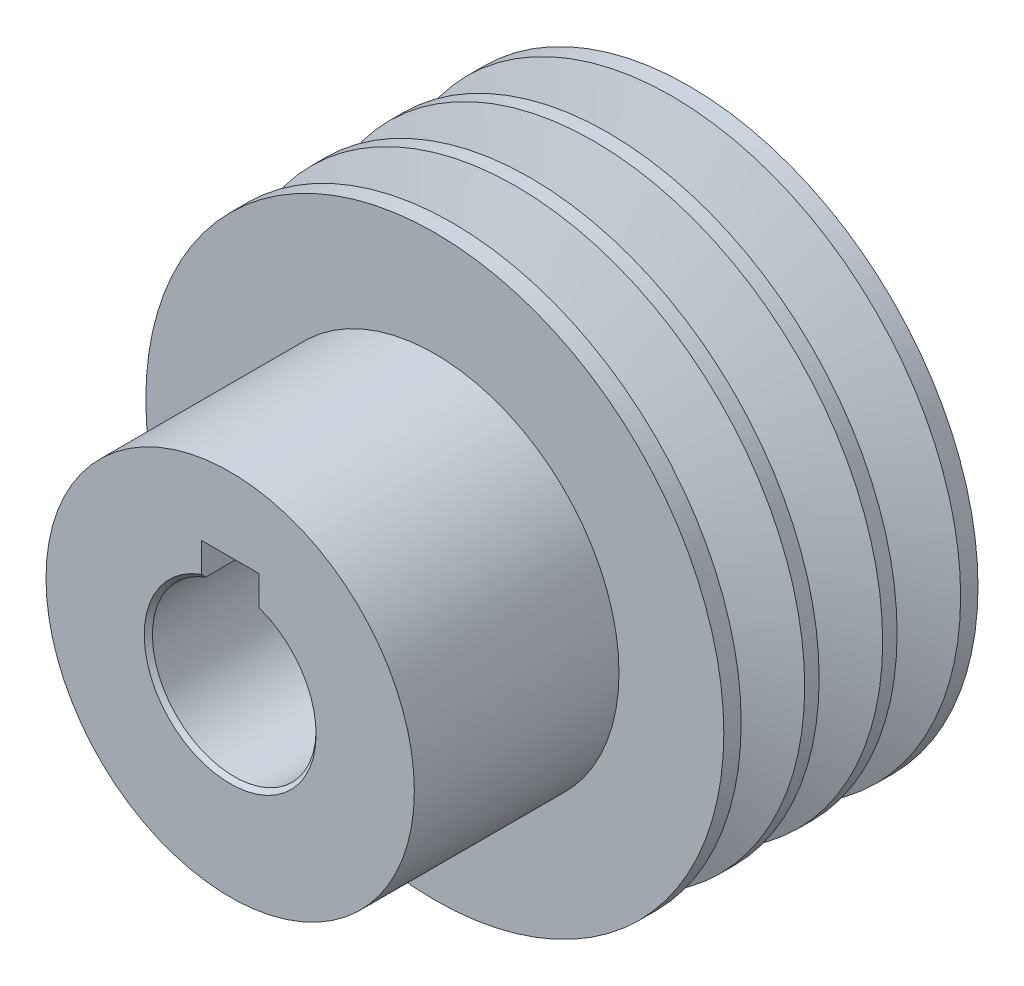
ISO-10303-21;
HEADER;
FILE_DESCRIPTION(('STEP AP214'),'2;1');
FILE_NAME('part.step','',(''),(''),'','','');
FILE_SCHEMA(('AUTOMOTIVE_DESIGN { 1 0 10303 214 1 1 1 1 }'));
ENDSEC;
DATA;
#1=APPLICATION_CONTEXT('core data for automotive mechanical design processes');
#2=APPLICATION_PROTOCOL_DEFINITION('international standard','automotive_design',2000,#1);
#3=PRODUCT_CONTEXT('',#1,'mechanical');
#4=PRODUCT('Part','Part','',(#3));
#5=PRODUCT_RELATED_PRODUCT_CATEGORY('part','',(#4));
#6=PRODUCT_DEFINITION_FORMATION('','',#4);
#7=PRODUCT_DEFINITION_CONTEXT('part definition',#1,'design');
#8=PRODUCT_DEFINITION('design','',#6,#7);
#9=PRODUCT_DEFINITION_SHAPE('','',#8);
#10=(LENGTH_UNIT() NAMED_UNIT(*) SI_UNIT(.MILLI.,.METRE.));
#11=(NAMED_UNIT(*) PLANE_ANGLE_UNIT() SI_UNIT($,.RADIAN.));
#12=(NAMED_UNIT(*) SI_UNIT($,.STERADIAN.) SOLID_ANGLE_UNIT());
#13=UNCERTAINTY_MEASURE_WITH_UNIT(LENGTH_MEASURE(1.E-05),#10,'distance_accuracy_value','');
#14=(GEOMETRIC_REPRESENTATION_CONTEXT(3) GLOBAL_UNCERTAINTY_ASSIGNED_CONTEXT((#13)) GLOBAL_UNIT_ASSIGNED_CONTEXT((#10,
#11,#12)) REPRESENTATION_CONTEXT('',''));
#15=CARTESIAN_POINT('',(0.,0.,0.));
#16=DIRECTION('',(0.,0.,1.));
#17=DIRECTION('',(1.,0.,0.));
#18=AXIS2_PLACEMENT_3D('',#15,#16,#17);
#19=CARTESIAN_POINT('',(0.,70.6119995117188,50.1014986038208));
#20=DIRECTION('',(0.,0.,-1.));
#21=DIRECTION('',(-1.,0.,0.));
#22=AXIS2_PLACEMENT_3D('',#19,#20,#21);
#23=PLANE('',#22);
#24=CARTESIAN_POINT('',(0.,0.,50.1014986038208));
#25=DIRECTION('',(0.,0.,1.));
#26=DIRECTION('',(1.,0.,0.));
#27=AXIS2_PLACEMENT_3D('',#24,#25,#26);
#28=CIRCLE('',#27,70.6119995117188);
#29=CARTESIAN_POINT('',(70.6119995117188,0.,50.1014986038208));
#30=VERTEX_POINT('',#29);
#31=EDGE_CURVE('E125',#30,#30,#28,.T.);
#32=ORIENTED_EDGE('',*,*,#31,.T.);
#33=EDGE_LOOP('',(#32));
#34=FACE_BOUND('',#33,.T.);
#35=CARTESIAN_POINT('',(0.,0.,50.1014986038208));
#36=DIRECTION('',(0.,0.,-1.));
#37=DIRECTION('',(-1.,0.,0.));
#38=AXIS2_PLACEMENT_3D('',#35,#36,#37);
#39=CIRCLE('',#38,45.);
#40=CARTESIAN_POINT('',(-45.,0.,50.1014986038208));
#41=VERTEX_POINT('',#40);
#42=EDGE_CURVE('E167',#41,#41,#39,.F.);
#43=ORIENTED_EDGE('',*,*,#42,.F.);
#44=EDGE_LOOP('',(#43));
#45=FACE_BOUND('',#44,.T.);
#46=ADVANCED_FACE('F30',(#34,#45),#23,.F.);
#47=CARTESIAN_POINT('',(0.,0.,-12.0015001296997));
#48=DIRECTION('',(0.,0.,1.));
#49=DIRECTION('',(1.,0.,0.));
#50=AXIS2_PLACEMENT_3D('',#47,#48,#49);
#51=PLANE('',#50);
#52=DIRECTION('',(0.,-1.,0.));
#53=VECTOR('',#52,1.);
#54=CARTESIAN_POINT('',(-7.,27.,-12.0015001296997));
#55=LINE('',#54,#53);
#56=CARTESIAN_POINT('',(-7.,27.,-12.0015001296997));
#57=VERTEX_POINT('',#56);
#58=CARTESIAN_POINT('',(-7.,19.7989898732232,-12.0015001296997));
#59=VERTEX_POINT('',#58);
#60=EDGE_CURVE('E97',#57,#59,#55,.T.);
#61=ORIENTED_EDGE('',*,*,#60,.T.);
#62=CARTESIAN_POINT('',(0.,0.,-12.0015001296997));
#63=DIRECTION('',(0.,0.,1.));
#64=DIRECTION('',(1.,0.,0.));
#65=AXIS2_PLACEMENT_3D('',#62,#63,#64);
#66=CIRCLE('',#65,20.9999999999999);
#67=CARTESIAN_POINT('',(7.,19.7989898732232,-12.0015001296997));
#68=VERTEX_POINT('',#67);
#69=EDGE_CURVE('E170',#59,#68,#66,.T.);
#70=ORIENTED_EDGE('',*,*,#69,.T.);
#71=DIRECTION('',(0.,1.,0.));
#72=VECTOR('',#71,1.);
#73=CARTESIAN_POINT('',(7.,18.7349939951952,-12.0015001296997));
#74=LINE('',#73,#72);
#75=CARTESIAN_POINT('',(7.,27.,-12.0015001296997));
#76=VERTEX_POINT('',#75);
#77=EDGE_CURVE('E94',#68,#76,#74,.T.);
#78=ORIENTED_EDGE('',*,*,#77,.T.);
#79=DIRECTION('',(-1.,0.,0.));
#80=VECTOR('',#79,1.);
#81=CARTESIAN_POINT('',(7.,27.,-12.0015001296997));
#82=LINE('',#81,#80);
#83=EDGE_CURVE('E90',#76,#57,#82,.T.);
#84=ORIENTED_EDGE('',*,*,#83,.T.);
#85=EDGE_LOOP('',(#61,#70,#78,#84));
#86=FACE_BOUND('',#85,.T.);
#87=CARTESIAN_POINT('',(0.,0.,-12.0015001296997));
#88=DIRECTION('',(0.,0.,1.));
#89=DIRECTION('',(1.,0.,0.));
#90=AXIS2_PLACEMENT_3D('',#87,#88,#89);
#91=CIRCLE('',#90,70.6119995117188);
#92=CARTESIAN_POINT('',(70.6119995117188,0.,-12.0015001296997));
#93=VERTEX_POINT('',#92);
#94=EDGE_CURVE('E164',#93,#93,#91,.T.);
#95=ORIENTED_EDGE('',*,*,#94,.F.);
#96=EDGE_LOOP('',(#95));
#97=FACE_BOUND('',#96,.T.);
#98=ADVANCED_FACE('F104',(#86,#97),#51,.F.);
#99=CARTESIAN_POINT('',(0.,0.,62.1029987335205));
#100=DIRECTION('',(0.,0.,1.));
#101=DIRECTION('',(1.,0.,0.));
#102=AXIS2_PLACEMENT_3D('',#99,#100,#101);
#103=CYLINDRICAL_SURFACE('',#102,70.6119995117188);
#104=CARTESIAN_POINT('',(0.,0.,-7.75969982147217));
#105=DIRECTION('',(0.,0.,1.));
#106=DIRECTION('',(1.,0.,0.));
#107=AXIS2_PLACEMENT_3D('',#104,#105,#106);
#108=CIRCLE('',#107,70.6119995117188);
#109=CARTESIAN_POINT('',(70.6119995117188,0.,-7.75969982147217));
#110=VERTEX_POINT('',#109);
#111=EDGE_CURVE('E161',#110,#110,#108,.T.);
#112=ORIENTED_EDGE('',*,*,#111,.F.);
#113=EDGE_LOOP('',(#112));
#114=FACE_BOUND('',#113,.T.);
#115=ORIENTED_EDGE('',*,*,#94,.T.);
#116=EDGE_LOOP('',(#115));
#117=FACE_BOUND('',#116,.T.);
#118=ADVANCED_FACE('F214',(#114,#117),#103,.T.);
#119=CARTESIAN_POINT('',(0.,0.,-7.75969982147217));
#120=DIRECTION('',(0.,0.,-1.));
#121=DIRECTION('',(-1.,0.,0.));
#122=AXIS2_PLACEMENT_3D('',#119,#120,#121);
#123=CONICAL_SURFACE('',#122,70.6119995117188,1.23918377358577);
#124=CARTESIAN_POINT('',(0.,0.,-2.11858081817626));
#125=DIRECTION('',(0.,0.,1.));
#126=DIRECTION('',(1.,0.,0.));
#127=AXIS2_PLACEMENT_3D('',#124,#125,#126);
#128=CIRCLE('',#127,54.2290000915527);
#129=CARTESIAN_POINT('',(54.2290000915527,0.,-2.11858081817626));
#130=VERTEX_POINT('',#129);
#131=EDGE_CURVE('E158',#130,#130,#128,.T.);
#132=ORIENTED_EDGE('',*,*,#131,.F.);
#133=EDGE_LOOP('',(#132));
#134=FACE_BOUND('',#133,.T.);
#135=ORIENTED_EDGE('',*,*,#111,.T.);
#136=EDGE_LOOP('',(#135));
#137=FACE_BOUND('',#136,.T.);
#138=ADVANCED_FACE('F217',(#134,#137),#123,.T.);
#139=CARTESIAN_POINT('',(0.,0.,62.1029987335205));
#140=DIRECTION('',(0.,0.,1.));
#141=DIRECTION('',(1.,0.,0.));
#142=AXIS2_PLACEMENT_3D('',#139,#140,#141);
#143=CYLINDRICAL_SURFACE('',#142,54.2290000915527);
#144=CARTESIAN_POINT('',(0.,0.,2.11858081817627));
#145=DIRECTION('',(0.,0.,1.));
#146=DIRECTION('',(1.,0.,0.));
#147=AXIS2_PLACEMENT_3D('',#144,#145,#146);
#148=CIRCLE('',#147,54.2290000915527);
#149=CARTESIAN_POINT('',(54.2290000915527,0.,2.11858081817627));
#150=VERTEX_POINT('',#149);
#151=EDGE_CURVE('E155',#150,#150,#148,.T.);
#152=ORIENTED_EDGE('',*,*,#151,.F.);
#153=EDGE_LOOP('',(#152));
#154=FACE_BOUND('',#153,.T.);
#155=ORIENTED_EDGE('',*,*,#131,.T.);
#156=EDGE_LOOP('',(#155));
#157=FACE_BOUND('',#156,.T.);
#158=ADVANCED_FACE('F221',(#154,#157),#143,.T.);
#159=CARTESIAN_POINT('',(0.,0.,2.11858081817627));
#160=DIRECTION('',(0.,0.,1.));
#161=DIRECTION('',(1.,0.,0.));
#162=AXIS2_PLACEMENT_3D('',#159,#160,#161);
#163=CONICAL_SURFACE('',#162,54.2290000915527,1.23918377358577);
#164=CARTESIAN_POINT('',(0.,0.,7.75969982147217));
#165=DIRECTION('',(0.,0.,1.));
#166=DIRECTION('',(1.,0.,0.));
#167=AXIS2_PLACEMENT_3D('',#164,#165,#166);
#168=CIRCLE('',#167,70.6119995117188);
#169=CARTESIAN_POINT('',(70.6119995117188,0.,7.75969982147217));
#170=VERTEX_POINT('',#169);
#171=EDGE_CURVE('E152',#170,#170,#168,.T.);
#172=ORIENTED_EDGE('',*,*,#171,.F.);
#173=EDGE_LOOP('',(#172));
#174=FACE_BOUND('',#173,.T.);
#175=ORIENTED_EDGE('',*,*,#151,.T.);
#176=EDGE_LOOP('',(#175));
#177=FACE_BOUND('',#176,.T.);
#178=ADVANCED_FACE('F225',(#174,#177),#163,.T.);
#179=CARTESIAN_POINT('',(0.,0.,62.1029987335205));
#180=DIRECTION('',(0.,0.,1.));
#181=DIRECTION('',(1.,0.,0.));
#182=AXIS2_PLACEMENT_3D('',#179,#180,#181);
#183=CYLINDRICAL_SURFACE('',#182,70.6119995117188);
#184=CARTESIAN_POINT('',(0.,0.,11.2902994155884));
#185=DIRECTION('',(0.,0.,1.));
#186=DIRECTION('',(1.,0.,0.));
#187=AXIS2_PLACEMENT_3D('',#184,#185,#186);
#188=CIRCLE('',#187,70.6119995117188);
#189=CARTESIAN_POINT('',(70.6119995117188,0.,11.2902994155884));
#190=VERTEX_POINT('',#189);
#191=EDGE_CURVE('E149',#190,#190,#188,.T.);
#192=ORIENTED_EDGE('',*,*,#191,.F.);
#193=EDGE_LOOP('',(#192));
#194=FACE_BOUND('',#193,.T.);
#195=ORIENTED_EDGE('',*,*,#171,.T.);
#196=EDGE_LOOP('',(#195));
#197=FACE_BOUND('',#196,.T.);
#198=ADVANCED_FACE('F229',(#194,#197),#183,.T.);
#199=CARTESIAN_POINT('',(0.,0.,11.2902994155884));
#200=DIRECTION('',(0.,0.,-1.));
#201=DIRECTION('',(-1.,0.,0.));
#202=AXIS2_PLACEMENT_3D('',#199,#200,#201);
#203=CONICAL_SURFACE('',#202,70.6119995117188,1.23918377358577);
#204=CARTESIAN_POINT('',(0.,0.,16.9314184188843));
#205=DIRECTION('',(0.,0.,1.));
#206=DIRECTION('',(1.,0.,0.));
#207=AXIS2_PLACEMENT_3D('',#204,#205,#206);
#208=CIRCLE('',#207,54.2290000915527);
#209=CARTESIAN_POINT('',(54.2290000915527,0.,16.9314184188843));
#210=VERTEX_POINT('',#209);
#211=EDGE_CURVE('E146',#210,#210,#208,.T.);
#212=ORIENTED_EDGE('',*,*,#211,.F.);
#213=EDGE_LOOP('',(#212));
#214=FACE_BOUND('',#213,.T.);
#215=ORIENTED_EDGE('',*,*,#191,.T.);
#216=EDGE_LOOP('',(#215));
#217=FACE_BOUND('',#216,.T.);
#218=ADVANCED_FACE('F233',(#214,#217),#203,.T.);
#219=CARTESIAN_POINT('',(0.,0.,62.1029987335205));
#220=DIRECTION('',(0.,0.,1.));
#221=DIRECTION('',(1.,0.,0.));
#222=AXIS2_PLACEMENT_3D('',#219,#220,#221);
#223=CYLINDRICAL_SURFACE('',#222,54.2290000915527);
#224=CARTESIAN_POINT('',(0.,0.,21.1685800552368));
#225=DIRECTION('',(0.,0.,1.));
#226=DIRECTION('',(1.,0.,0.));
#227=AXIS2_PLACEMENT_3D('',#224,#225,#226);
#228=CIRCLE('',#227,54.2290000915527);
#229=CARTESIAN_POINT('',(54.2290000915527,0.,21.1685800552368));
#230=VERTEX_POINT('',#229);
#231=EDGE_CURVE('E143',#230,#230,#228,.T.);
#232=ORIENTED_EDGE('',*,*,#231,.F.);
#233=EDGE_LOOP('',(#232));
#234=FACE_BOUND('',#233,.T.);
#235=ORIENTED_EDGE('',*,*,#211,.T.);
#236=EDGE_LOOP('',(#235));
#237=FACE_BOUND('',#236,.T.);
#238=ADVANCED_FACE('F237',(#234,#237),#223,.T.);
#239=CARTESIAN_POINT('',(0.,0.,21.1685800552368));
#240=DIRECTION('',(0.,0.,1.));
#241=DIRECTION('',(1.,0.,0.));
#242=AXIS2_PLACEMENT_3D('',#239,#240,#241);
#243=CONICAL_SURFACE('',#242,54.2290000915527,1.23918377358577);
#244=CARTESIAN_POINT('',(0.,0.,26.8096990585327));
#245=DIRECTION('',(0.,0.,1.));
#246=DIRECTION('',(1.,0.,0.));
#247=AXIS2_PLACEMENT_3D('',#244,#245,#246);
#248=CIRCLE('',#247,70.6119995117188);
#249=CARTESIAN_POINT('',(70.6119995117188,0.,26.8096990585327));
#250=VERTEX_POINT('',#249);
#251=EDGE_CURVE('E140',#250,#250,#248,.T.);
#252=ORIENTED_EDGE('',*,*,#251,.F.);
#253=EDGE_LOOP('',(#252));
#254=FACE_BOUND('',#253,.T.);
#255=ORIENTED_EDGE('',*,*,#231,.T.);
#256=EDGE_LOOP('',(#255));
#257=FACE_BOUND('',#256,.T.);
#258=ADVANCED_FACE('F241',(#254,#257),#243,.T.);
#259=CARTESIAN_POINT('',(0.,0.,62.1029987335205));
#260=DIRECTION('',(0.,0.,1.));
#261=DIRECTION('',(1.,0.,0.));
#262=AXIS2_PLACEMENT_3D('',#259,#260,#261);
#263=CYLINDRICAL_SURFACE('',#262,70.6119995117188);
#264=CARTESIAN_POINT('',(0.,0.,30.3402986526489));
#265=DIRECTION('',(0.,0.,1.));
#266=DIRECTION('',(1.,0.,0.));
#267=AXIS2_PLACEMENT_3D('',#264,#265,#266);
#268=CIRCLE('',#267,70.6119995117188);
#269=CARTESIAN_POINT('',(70.6119995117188,0.,30.3402986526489));
#270=VERTEX_POINT('',#269);
#271=EDGE_CURVE('E137',#270,#270,#268,.T.);
#272=ORIENTED_EDGE('',*,*,#271,.F.);
#273=EDGE_LOOP('',(#272));
#274=FACE_BOUND('',#273,.T.);
#275=ORIENTED_EDGE('',*,*,#251,.T.);
#276=EDGE_LOOP('',(#275));
#277=FACE_BOUND('',#276,.T.);
#278=ADVANCED_FACE('F245',(#274,#277),#263,.T.);
#279=CARTESIAN_POINT('',(0.,0.,30.3402986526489));
#280=DIRECTION('',(0.,0.,-1.));
#281=DIRECTION('',(-1.,0.,0.));
#282=AXIS2_PLACEMENT_3D('',#279,#280,#281);
#283=CONICAL_SURFACE('',#282,70.6119995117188,1.23918377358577);
#284=CARTESIAN_POINT('',(0.,0.,35.9814176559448));
#285=DIRECTION('',(0.,0.,1.));
#286=DIRECTION('',(1.,0.,0.));
#287=AXIS2_PLACEMENT_3D('',#284,#285,#286);
#288=CIRCLE('',#287,54.2290000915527);
#289=CARTESIAN_POINT('',(54.2290000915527,0.,35.9814176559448));
#290=VERTEX_POINT('',#289);
#291=EDGE_CURVE('E134',#290,#290,#288,.T.);
#292=ORIENTED_EDGE('',*,*,#291,.F.);
#293=EDGE_LOOP('',(#292));
#294=FACE_BOUND('',#293,.T.);
#295=ORIENTED_EDGE('',*,*,#271,.T.);
#296=EDGE_LOOP('',(#295));
#297=FACE_BOUND('',#296,.T.);
#298=ADVANCED_FACE('F249',(#294,#297),#283,.T.);
#299=CARTESIAN_POINT('',(0.,0.,62.1029987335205));
#300=DIRECTION('',(0.,0.,1.));
#301=DIRECTION('',(1.,0.,0.));
#302=AXIS2_PLACEMENT_3D('',#299,#300,#301);
#303=CYLINDRICAL_SURFACE('',#302,54.2290000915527);
#304=CARTESIAN_POINT('',(0.,0.,40.2185792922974));
#305=DIRECTION('',(0.,0.,1.));
#306=DIRECTION('',(1.,0.,0.));
#307=AXIS2_PLACEMENT_3D('',#304,#305,#306);
#308=CIRCLE('',#307,54.2290000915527);
#309=CARTESIAN_POINT('',(54.2290000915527,0.,40.2185792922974));
#310=VERTEX_POINT('',#309);
#311=EDGE_CURVE('E131',#310,#310,#308,.T.);
#312=ORIENTED_EDGE('',*,*,#311,.F.);
#313=EDGE_LOOP('',(#312));
#314=FACE_BOUND('',#313,.T.);
#315=ORIENTED_EDGE('',*,*,#291,.T.);
#316=EDGE_LOOP('',(#315));
#317=FACE_BOUND('',#316,.T.);
#318=ADVANCED_FACE('F253',(#314,#317),#303,.T.);
#319=CARTESIAN_POINT('',(0.,0.,40.2185792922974));
#320=DIRECTION('',(0.,0.,1.));
#321=DIRECTION('',(1.,0.,0.));
#322=AXIS2_PLACEMENT_3D('',#319,#320,#321);
#323=CONICAL_SURFACE('',#322,54.2290000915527,1.23918377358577);
#324=CARTESIAN_POINT('',(0.,0.,45.8596982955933));
#325=DIRECTION('',(0.,0.,1.));
#326=DIRECTION('',(1.,0.,0.));
#327=AXIS2_PLACEMENT_3D('',#324,#325,#326);
#328=CIRCLE('',#327,70.6119995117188);
#329=CARTESIAN_POINT('',(70.6119995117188,0.,45.8596982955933));
#330=VERTEX_POINT('',#329);
#331=EDGE_CURVE('E128',#330,#330,#328,.T.);
#332=ORIENTED_EDGE('',*,*,#331,.F.);
#333=EDGE_LOOP('',(#332));
#334=FACE_BOUND('',#333,.T.);
#335=ORIENTED_EDGE('',*,*,#311,.T.);
#336=EDGE_LOOP('',(#335));
#337=FACE_BOUND('',#336,.T.);
#338=ADVANCED_FACE('F257',(#334,#337),#323,.T.);
#339=CARTESIAN_POINT('',(0.,0.,62.1029987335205));
#340=DIRECTION('',(0.,0.,1.));
#341=DIRECTION('',(1.,0.,0.));
#342=AXIS2_PLACEMENT_3D('',#339,#340,#341);
#343=CYLINDRICAL_SURFACE('',#342,70.6119995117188);
#344=ORIENTED_EDGE('',*,*,#31,.F.);
#345=EDGE_LOOP('',(#344));
#346=FACE_BOUND('',#345,.T.);
#347=ORIENTED_EDGE('',*,*,#331,.T.);
#348=EDGE_LOOP('',(#347));
#349=FACE_BOUND('',#348,.T.);
#350=ADVANCED_FACE('F261',(#346,#349),#343,.T.);
#351=CARTESIAN_POINT('',(0.,0.,100.101498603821));
#352=DIRECTION('',(0.,0.,-1.));
#353=DIRECTION('',(-1.,0.,0.));
#354=AXIS2_PLACEMENT_3D('',#351,#352,#353);
#355=CYLINDRICAL_SURFACE('',#354,45.);
#356=CARTESIAN_POINT('',(0.,0.,100.101498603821));
#357=DIRECTION('',(0.,0.,1.));
#358=DIRECTION('',(1.,0.,0.));
#359=AXIS2_PLACEMENT_3D('',#356,#357,#358);
#360=CIRCLE('',#359,45.);
#361=CARTESIAN_POINT('',(45.,0.,100.101498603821));
#362=VERTEX_POINT('',#361);
#363=EDGE_CURVE('E118',#362,#362,#360,.T.);
#364=ORIENTED_EDGE('',*,*,#363,.F.);
#365=EDGE_LOOP('',(#364));
#366=FACE_BOUND('',#365,.T.);
#367=ORIENTED_EDGE('',*,*,#42,.T.);
#368=EDGE_LOOP('',(#367));
#369=FACE_BOUND('',#368,.T.);
#370=ADVANCED_FACE('F265',(#366,#369),#355,.T.);
#371=CARTESIAN_POINT('',(0.,0.,100.101498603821));
#372=DIRECTION('',(0.,0.,1.));
#373=DIRECTION('',(1.,0.,0.));
#374=AXIS2_PLACEMENT_3D('',#371,#372,#373);
#375=PLANE('',#374);
#376=DIRECTION('',(0.,1.,0.));
#377=VECTOR('',#376,1.);
#378=CARTESIAN_POINT('',(7.,18.7349939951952,100.101498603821));
#379=LINE('',#378,#377);
#380=CARTESIAN_POINT('',(7.,19.7989898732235,100.101498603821));
#381=VERTEX_POINT('',#380);
#382=CARTESIAN_POINT('',(7.,27.,100.101498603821));
#383=VERTEX_POINT('',#382);
#384=EDGE_CURVE('E108',#381,#383,#379,.T.);
#385=ORIENTED_EDGE('',*,*,#384,.F.);
#386=CARTESIAN_POINT('',(0.,0.,100.101498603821));
#387=DIRECTION('',(0.,0.,1.));
#388=DIRECTION('',(1.,0.,0.));
#389=AXIS2_PLACEMENT_3D('',#386,#387,#388);
#390=CIRCLE('',#389,21.0000000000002);
#391=CARTESIAN_POINT('',(-7.,19.7989898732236,100.101498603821));
#392=VERTEX_POINT('',#391);
#393=EDGE_CURVE('E11',#381,#392,#390,.F.);
#394=ORIENTED_EDGE('',*,*,#393,.T.);
#395=DIRECTION('',(0.,-1.,0.));
#396=VECTOR('',#395,1.);
#397=CARTESIAN_POINT('',(-7.,27.,100.101498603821));
#398=LINE('',#397,#396);
#399=CARTESIAN_POINT('',(-7.,27.,100.101498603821));
#400=VERTEX_POINT('',#399);
#401=EDGE_CURVE('E110',#400,#392,#398,.T.);
#402=ORIENTED_EDGE('',*,*,#401,.F.);
#403=DIRECTION('',(-1.,0.,0.));
#404=VECTOR('',#403,1.);
#405=CARTESIAN_POINT('',(7.,27.,100.101498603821));
#406=LINE('',#405,#404);
#407=EDGE_CURVE('E92',#383,#400,#406,.T.);
#408=ORIENTED_EDGE('',*,*,#407,.F.);
#409=EDGE_LOOP('',(#385,#394,#402,#408));
#410=FACE_BOUND('',#409,.T.);
#411=ORIENTED_EDGE('',*,*,#363,.T.);
#412=EDGE_LOOP('',(#411));
#413=FACE_BOUND('',#412,.T.);
#414=ADVANCED_FACE('F271',(#410,#413),#375,.T.);
#415=CARTESIAN_POINT('',(7.,27.,-12.0015001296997));
#416=DIRECTION('',(0.,1.,0.));
#417=DIRECTION('',(0.,0.,1.));
#418=AXIS2_PLACEMENT_3D('',#415,#416,#417);
#419=PLANE('',#418);
#420=ORIENTED_EDGE('',*,*,#407,.T.);
#421=DIRECTION('',(0.,0.,1.));
#422=VECTOR('',#421,1.);
#423=CARTESIAN_POINT('',(-7.,27.,-12.0015001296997));
#424=LINE('',#423,#422);
#425=EDGE_CURVE('E85',#57,#400,#424,.T.);
#426=ORIENTED_EDGE('',*,*,#425,.F.);
#427=ORIENTED_EDGE('',*,*,#83,.F.);
#428=DIRECTION('',(0.,0.,1.));
#429=VECTOR('',#428,1.);
#430=CARTESIAN_POINT('',(7.,27.,-12.0015001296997));
#431=LINE('',#430,#429);
#432=EDGE_CURVE('E116',#76,#383,#431,.T.);
#433=ORIENTED_EDGE('',*,*,#432,.T.);
#434=EDGE_LOOP('',(#420,#426,#427,#433));
#435=FACE_BOUND('',#434,.T.);
#436=ADVANCED_FACE('F87',(#435),#419,.F.);
#437=CARTESIAN_POINT('',(7.,18.7349939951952,-12.0015001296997));
#438=DIRECTION('',(1.,0.,0.));
#439=DIRECTION('',(0.,0.,-1.));
#440=AXIS2_PLACEMENT_3D('',#437,#438,#439);
#441=PLANE('',#440);
#442=ORIENTED_EDGE('',*,*,#77,.F.);
#443=CARTESIAN_POINT('',(7.,19.7989898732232,-12.0015001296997));
#444=CARTESIAN_POINT('',(7.,19.6219251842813,-11.834548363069));
#445=CARTESIAN_POINT('',(7.,19.444726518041,-11.6677391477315));
#446=CARTESIAN_POINT('',(7.,19.0900612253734,-11.3344058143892));
#447=CARTESIAN_POINT('',(7.,18.9125945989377,-11.1678816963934));
#448=CARTESIAN_POINT('',(7.,18.7349939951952,-11.0015001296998));
#449=B_SPLINE_CURVE_WITH_KNOTS('',3,(#443,#444,#445,#446,#447,#448),.UNSPECIFIED.,.F.,.F.,(4,2,
4),(0.,0.730083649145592,1.46016732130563),.UNSPECIFIED.);
#450=CARTESIAN_POINT('',(7.,18.7349939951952,-11.0015001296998));
#451=VERTEX_POINT('',#450);
#452=EDGE_CURVE('E178',#68,#451,#449,.T.);
#453=ORIENTED_EDGE('',*,*,#452,.T.);
#454=DIRECTION('',(0.,0.,1.));
#455=VECTOR('',#454,1.);
#456=CARTESIAN_POINT('',(7.,18.7349939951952,-12.0015001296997));
#457=LINE('',#456,#455);
#458=CARTESIAN_POINT('',(7.,18.7349939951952,99.1014986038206));
#459=VERTEX_POINT('',#458);
#460=EDGE_CURVE('E119',#451,#459,#457,.T.);
#461=ORIENTED_EDGE('',*,*,#460,.T.);
#462=CARTESIAN_POINT('',(7.,18.7349939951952,99.1014986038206));
#463=CARTESIAN_POINT('',(7.,18.9125945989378,99.2678801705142));
#464=CARTESIAN_POINT('',(7.,19.0900612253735,99.4344042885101));
#465=CARTESIAN_POINT('',(7.,19.4447265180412,99.7677376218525));
#466=CARTESIAN_POINT('',(7.,19.6219251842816,99.93454683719));
#467=CARTESIAN_POINT('',(7.,19.7989898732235,100.101498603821));
#468=B_SPLINE_CURVE_WITH_KNOTS('',3,(#462,#463,#464,#465,#466,#467),.UNSPECIFIED.,.F.,.F.,(4,2,
4),(0.,0.730083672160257,1.46016732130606),.UNSPECIFIED.);
#469=EDGE_CURVE('E172',#459,#381,#468,.T.);
#470=ORIENTED_EDGE('',*,*,#469,.T.);
#471=ORIENTED_EDGE('',*,*,#384,.T.);
#472=ORIENTED_EDGE('',*,*,#432,.F.);
#473=EDGE_LOOP('',(#442,#453,#461,#470,#471,#472));
#474=FACE_BOUND('',#473,.T.);
#475=ADVANCED_FACE('F183',(#474),#441,.F.);
#476=CARTESIAN_POINT('',(0.,0.,-12.0015001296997));
#477=DIRECTION('',(0.,0.,1.));
#478=DIRECTION('',(1.,0.,0.));
#479=AXIS2_PLACEMENT_3D('',#476,#477,#478);
#480=CYLINDRICAL_SURFACE('',#479,20.);
#481=ORIENTED_EDGE('',*,*,#460,.F.);
#482=CARTESIAN_POINT('',(0.,0.,-11.0015001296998));
#483=DIRECTION('',(0.,0.,1.));
#484=DIRECTION('',(1.,0.,0.));
#485=AXIS2_PLACEMENT_3D('',#482,#483,#484);
#486=CIRCLE('',#485,20.);
#487=CARTESIAN_POINT('',(-7.,18.7349939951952,-11.0015001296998));
#488=VERTEX_POINT('',#487);
#489=EDGE_CURVE('E286',#451,#488,#486,.F.);
#490=ORIENTED_EDGE('',*,*,#489,.T.);
#491=DIRECTION('',(0.,0.,1.));
#492=VECTOR('',#491,1.);
#493=CARTESIAN_POINT('',(-7.,18.7349939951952,-12.0015001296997));
#494=LINE('',#493,#492);
#495=CARTESIAN_POINT('',(-7.,18.7349939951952,99.1014986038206));
#496=VERTEX_POINT('',#495);
#497=EDGE_CURVE('E93',#488,#496,#494,.T.);
#498=ORIENTED_EDGE('',*,*,#497,.T.);
#499=CARTESIAN_POINT('',(0.,0.,99.1014986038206));
#500=DIRECTION('',(0.,0.,1.));
#501=DIRECTION('',(1.,0.,0.));
#502=AXIS2_PLACEMENT_3D('',#499,#500,#501);
#503=CIRCLE('',#502,20.);
#504=EDGE_CURVE('E285',#496,#459,#503,.T.);
#505=ORIENTED_EDGE('',*,*,#504,.T.);
#506=EDGE_LOOP('',(#481,#490,#498,#505));
#507=FACE_BOUND('',#506,.T.);
#508=ADVANCED_FACE('F187',(#507),#480,.F.);
#509=CARTESIAN_POINT('',(-7.,27.,-12.0015001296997));
#510=DIRECTION('',(-1.,0.,0.));
#511=DIRECTION('',(0.,0.,1.));
#512=AXIS2_PLACEMENT_3D('',#509,#510,#511);
#513=PLANE('',#512);
#514=ORIENTED_EDGE('',*,*,#497,.F.);
#515=CARTESIAN_POINT('',(-7.,18.7349939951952,-11.0015001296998));
#516=CARTESIAN_POINT('',(-7.,18.9125945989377,-11.1678816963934));
#517=CARTESIAN_POINT('',(-7.,19.0900612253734,-11.3344058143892));
#518=CARTESIAN_POINT('',(-7.,19.444726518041,-11.6677391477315));
#519=CARTESIAN_POINT('',(-7.,19.6219251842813,-11.834548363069));
#520=CARTESIAN_POINT('',(-7.,19.7989898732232,-12.0015001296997));
#521=B_SPLINE_CURVE_WITH_KNOTS('',3,(#515,#516,#517,#518,#519,#520),.UNSPECIFIED.,.F.,.F.,(4,2,
4),(0.,0.730083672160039,1.46016732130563),.UNSPECIFIED.);
#522=EDGE_CURVE('E39',#488,#59,#521,.T.);
#523=ORIENTED_EDGE('',*,*,#522,.T.);
#524=ORIENTED_EDGE('',*,*,#60,.F.);
#525=ORIENTED_EDGE('',*,*,#425,.T.);
#526=ORIENTED_EDGE('',*,*,#401,.T.);
#527=CARTESIAN_POINT('',(-7.,19.7989898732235,100.101498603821));
#528=CARTESIAN_POINT('',(-7.,19.6219251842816,99.93454683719));
#529=CARTESIAN_POINT('',(-7.,19.4447265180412,99.7677376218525));
#530=CARTESIAN_POINT('',(-7.,19.0900612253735,99.4344042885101));
#531=CARTESIAN_POINT('',(-7.,18.9125945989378,99.2678801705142));
#532=CARTESIAN_POINT('',(-7.,18.7349939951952,99.1014986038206));
#533=B_SPLINE_CURVE_WITH_KNOTS('',3,(#527,#528,#529,#530,#531,#532),.UNSPECIFIED.,.F.,.F.,(4,2,
4),(0.,0.730083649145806,1.46016732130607),.UNSPECIFIED.);
#534=EDGE_CURVE('E51',#392,#496,#533,.T.);
#535=ORIENTED_EDGE('',*,*,#534,.T.);
#536=EDGE_LOOP('',(#514,#523,#524,#525,#526,#535));
#537=FACE_BOUND('',#536,.T.);
#538=ADVANCED_FACE('F98',(#537),#513,.F.);
#539=CARTESIAN_POINT('',(0.,0.,-12.0015001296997));
#540=DIRECTION('',(0.,0.,-1.));
#541=DIRECTION('',(-1.,0.,0.));
#542=AXIS2_PLACEMENT_3D('',#539,#540,#541);
#543=CONICAL_SURFACE('',#542,20.9999999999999,0.78539816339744);
#544=ORIENTED_EDGE('',*,*,#522,.F.);
#545=ORIENTED_EDGE('',*,*,#489,.F.);
#546=ORIENTED_EDGE('',*,*,#452,.F.);
#547=ORIENTED_EDGE('',*,*,#69,.F.);
#548=EDGE_LOOP('',(#544,#545,#546,#547));
#549=FACE_BOUND('',#548,.T.);
#550=ADVANCED_FACE('F196',(#549),#543,.F.);
#551=CARTESIAN_POINT('',(0.,0.,99.1014986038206));
#552=DIRECTION('',(0.,0.,1.));
#553=DIRECTION('',(1.,0.,0.));
#554=AXIS2_PLACEMENT_3D('',#551,#552,#553);
#555=CONICAL_SURFACE('',#554,20.,0.785398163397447);
#556=ORIENTED_EDGE('',*,*,#534,.F.);
#557=ORIENTED_EDGE('',*,*,#393,.F.);
#558=ORIENTED_EDGE('',*,*,#469,.F.);
#559=ORIENTED_EDGE('',*,*,#504,.F.);
#560=EDGE_LOOP('',(#556,#557,#558,#559));
#561=FACE_BOUND('',#560,.T.);
#562=ADVANCED_FACE('F32',(#561),#555,.F.);
#563=CLOSED_SHELL('',(#46,#98,#118,#138,#158,#178,#198,#218,#238,#258,#278,#298,#318,#338,#350,
#370,#414,#436,#475,#508,#538,#550,#562));
#564=MANIFOLD_SOLID_BREP('B2',#563);
#565=ADVANCED_BREP_SHAPE_REPRESENTATION('',(#18,#564),#14);
#566=SHAPE_DEFINITION_REPRESENTATION(#9,#565);
ENDSEC;
END-ISO-10303-21;
